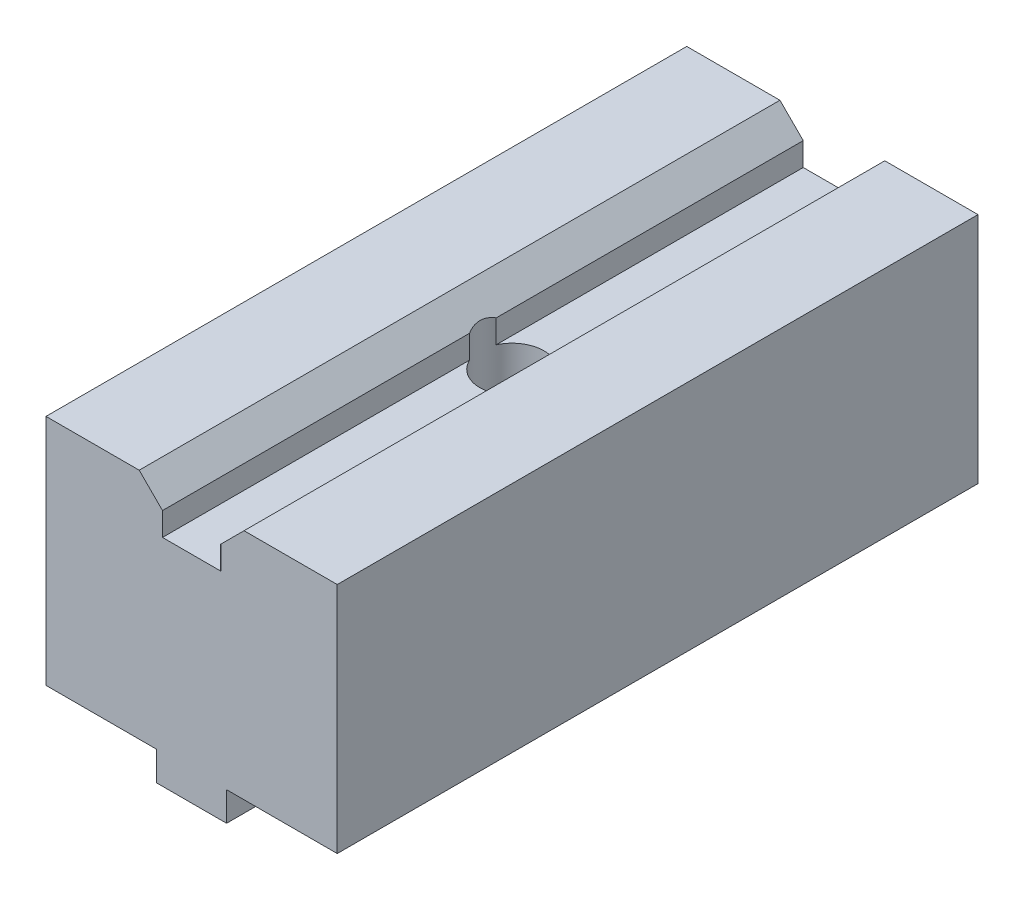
from build123d import *

# Parameters (mm, degrees)
AUFSATZ_LINEAR_AUSTRAGEN1_DEPTH                      = 27.5
SKIZZE6_W                                            = 6
SKIZZE6_H                                            = 2.5
AUFSATZ_LINEAR_AUSTRAGEN2_DEPTH                      = 55
STIRNSENKUNG_F_R_M2_5_ZYLINDERSCHRAUBE_M_D           = 2.9
STIRNSENKUNG_F_R_M2_5_ZYLINDERSCHRAUBE_M_CBORE_D     = 5.5
STIRNSENKUNG_F_R_M2_5_ZYLINDERSCHRAUBE_M_CBORE_DEPTH = 10


with BuildPart() as part:
    # Skizze1 → Aufsatz-Linear austragen1 (new, symmetric)
    with BuildSketch(Plane.XY):
        Polygon((12.5, -13.467801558), (-12.5, -13.467801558), (-12.5, 6.532198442), (-4.5, 6.532198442), (-2.5, 4.532198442), (-2.5, 2.532198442), (2.5, 2.532198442), (2.5, 4.532198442), (4.5, 6.532198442), (12.5, 6.532198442), align=None)
    extrude(amount=AUFSATZ_LINEAR_AUSTRAGEN1_DEPTH, both=True)

    # Skizze6 → Aufsatz-Linear austragen2 (add, through all)
    with BuildSketch(Plane.XY.offset(27.5)):
        with Locations((0, -14.717801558)):
            Rectangle(SKIZZE6_W, SKIZZE6_H)
    extrude(amount=-AUFSATZ_LINEAR_AUSTRAGEN2_DEPTH)

    # Stirnsenkung f_r M2.5 Zylinderschraube m (through all)
    with Locations(Plane(origin=(0, 6.532198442, 0), x_dir=(1, 0, 0), z_dir=(0, 1, 0))):
        with Locations((0, 0)):
            CounterBoreHole(STIRNSENKUNG_F_R_M2_5_ZYLINDERSCHRAUBE_M_D / 2, STIRNSENKUNG_F_R_M2_5_ZYLINDERSCHRAUBE_M_CBORE_D / 2, STIRNSENKUNG_F_R_M2_5_ZYLINDERSCHRAUBE_M_CBORE_DEPTH)


solid = part.part
